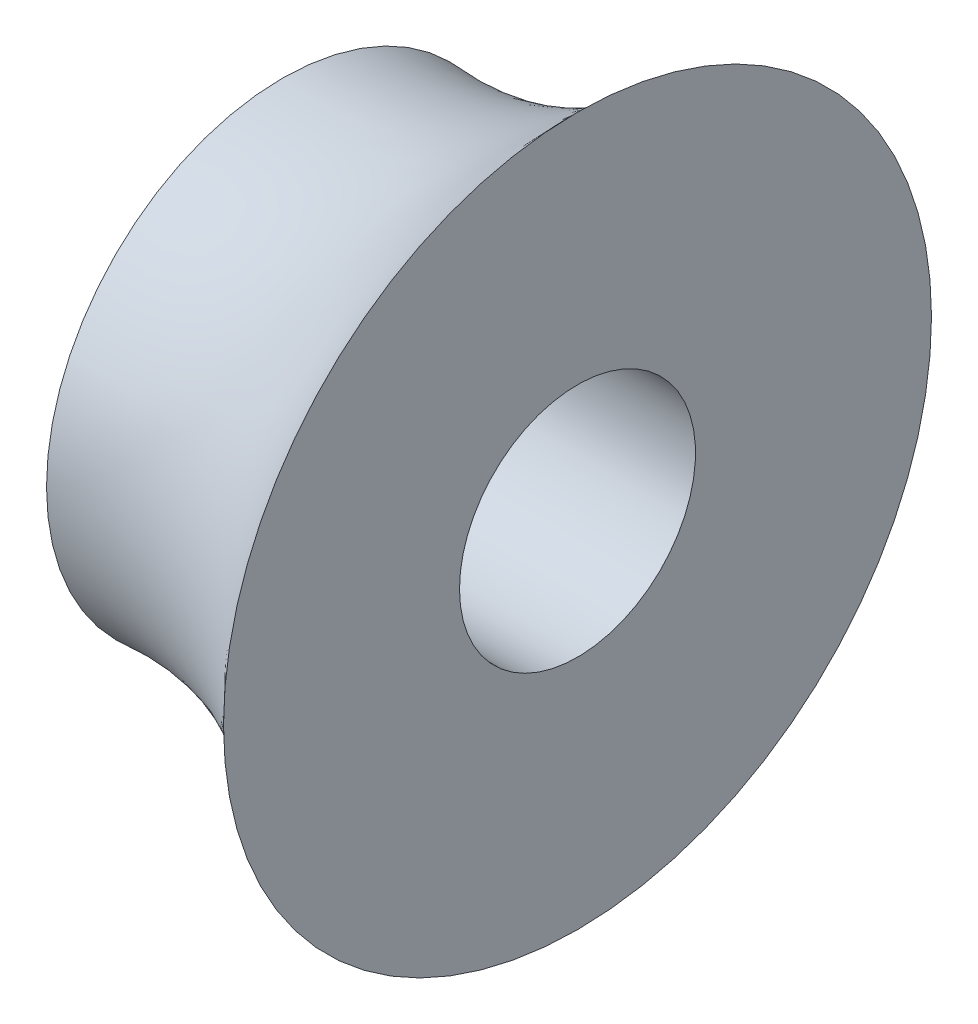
ISO-10303-21;
HEADER;
FILE_DESCRIPTION(('STEP AP214'),'2;1');
FILE_NAME('part.step','',(''),(''),'','','');
FILE_SCHEMA(('AUTOMOTIVE_DESIGN { 1 0 10303 214 1 1 1 1 }'));
ENDSEC;
DATA;
#1=APPLICATION_CONTEXT('core data for automotive mechanical design processes');
#2=APPLICATION_PROTOCOL_DEFINITION('international standard','automotive_design',2000,#1);
#3=PRODUCT_CONTEXT('',#1,'mechanical');
#4=PRODUCT('Part','Part','',(#3));
#5=PRODUCT_RELATED_PRODUCT_CATEGORY('part','',(#4));
#6=PRODUCT_DEFINITION_FORMATION('','',#4);
#7=PRODUCT_DEFINITION_CONTEXT('part definition',#1,'design');
#8=PRODUCT_DEFINITION('design','',#6,#7);
#9=PRODUCT_DEFINITION_SHAPE('','',#8);
#10=(LENGTH_UNIT() NAMED_UNIT(*) SI_UNIT(.MILLI.,.METRE.));
#11=(NAMED_UNIT(*) PLANE_ANGLE_UNIT() SI_UNIT($,.RADIAN.));
#12=(NAMED_UNIT(*) SI_UNIT($,.STERADIAN.) SOLID_ANGLE_UNIT());
#13=UNCERTAINTY_MEASURE_WITH_UNIT(LENGTH_MEASURE(1.E-05),#10,'distance_accuracy_value','');
#14=(GEOMETRIC_REPRESENTATION_CONTEXT(3) GLOBAL_UNCERTAINTY_ASSIGNED_CONTEXT((#13)) GLOBAL_UNIT_ASSIGNED_CONTEXT((#10,
#11,#12)) REPRESENTATION_CONTEXT('',''));
#15=CARTESIAN_POINT('',(0.,0.,0.));
#16=DIRECTION('',(0.,0.,1.));
#17=DIRECTION('',(1.,0.,0.));
#18=AXIS2_PLACEMENT_3D('',#15,#16,#17);
#19=CARTESIAN_POINT('',(-1.13694608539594,0.,0.));
#20=DIRECTION('',(-1.,0.,0.));
#21=DIRECTION('',(0.,0.,1.));
#22=AXIS2_PLACEMENT_3D('',#19,#20,#21);
#23=CYLINDRICAL_SURFACE('',#22,0.200000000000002);
#24=CARTESIAN_POINT('',(0.,0.,0.));
#25=DIRECTION('',(-1.,0.,0.));
#26=DIRECTION('',(0.,0.,1.));
#27=AXIS2_PLACEMENT_3D('',#24,#25,#26);
#28=CIRCLE('',#27,0.200000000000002);
#29=CARTESIAN_POINT('',(0.,0.,0.200000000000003));
#30=VERTEX_POINT('',#29);
#31=EDGE_CURVE('E10',#30,#30,#28,.T.);
#32=ORIENTED_EDGE('',*,*,#31,.F.);
#33=EDGE_LOOP('',(#32));
#34=FACE_BOUND('',#33,.T.);
#35=CARTESIAN_POINT('',(-0.5,0.,0.));
#36=DIRECTION('',(-1.,0.,0.));
#37=DIRECTION('',(0.,0.,1.));
#38=AXIS2_PLACEMENT_3D('',#35,#36,#37);
#39=CIRCLE('',#38,0.200000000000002);
#40=CARTESIAN_POINT('',(-0.5,0.,0.200000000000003));
#41=VERTEX_POINT('',#40);
#42=EDGE_CURVE('E36',#41,#41,#39,.T.);
#43=ORIENTED_EDGE('',*,*,#42,.T.);
#44=EDGE_LOOP('',(#43));
#45=FACE_BOUND('',#44,.T.);
#46=ADVANCED_FACE('F22',(#34,#45),#23,.F.);
#47=CARTESIAN_POINT('',(0.,0.,-0.2));
#48=DIRECTION('',(-1.,0.,0.));
#49=DIRECTION('',(0.,0.,1.));
#50=AXIS2_PLACEMENT_3D('',#47,#48,#49);
#51=PLANE('',#50);
#52=CARTESIAN_POINT('',(0.,0.,0.));
#53=DIRECTION('',(-1.,0.,0.));
#54=DIRECTION('',(0.,0.,1.));
#55=AXIS2_PLACEMENT_3D('',#52,#53,#54);
#56=CIRCLE('',#55,0.600000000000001);
#57=CARTESIAN_POINT('',(0.,0.,0.600000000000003));
#58=VERTEX_POINT('',#57);
#59=EDGE_CURVE('E28',#58,#58,#56,.T.);
#60=ORIENTED_EDGE('',*,*,#59,.F.);
#61=EDGE_LOOP('',(#60));
#62=FACE_BOUND('',#61,.T.);
#63=ORIENTED_EDGE('',*,*,#31,.T.);
#64=EDGE_LOOP('',(#63));
#65=FACE_BOUND('',#64,.T.);
#66=ADVANCED_FACE('F51',(#62,#65),#51,.F.);
#67=CARTESIAN_POINT('',(-0.449136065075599,0.,0.));
#68=DIRECTION('',(-1.,0.,0.));
#69=DIRECTION('',(0.,0.,1.));
#70=AXIS2_PLACEMENT_3D('',#67,#68,#69);
#71=TOROIDAL_SURFACE('',#70,0.997840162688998,0.6);
#72=CARTESIAN_POINT('',(-0.5,0.,0.));
#73=DIRECTION('',(-1.,0.,0.));
#74=DIRECTION('',(0.,0.,1.));
#75=AXIS2_PLACEMENT_3D('',#72,#73,#74);
#76=CIRCLE('',#75,0.400000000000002);
#77=CARTESIAN_POINT('',(-0.5,0.,0.400000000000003));
#78=VERTEX_POINT('',#77);
#79=EDGE_CURVE('E32',#78,#78,#76,.T.);
#80=ORIENTED_EDGE('',*,*,#79,.F.);
#81=EDGE_LOOP('',(#80));
#82=FACE_BOUND('',#81,.T.);
#83=ORIENTED_EDGE('',*,*,#59,.T.);
#84=EDGE_LOOP('',(#83));
#85=FACE_BOUND('',#84,.T.);
#86=ADVANCED_FACE('F46',(#82,#85),#71,.F.);
#87=CARTESIAN_POINT('',(-0.5,0.,-0.2));
#88=DIRECTION('',(1.,0.,0.));
#89=DIRECTION('',(0.,0.,-1.));
#90=AXIS2_PLACEMENT_3D('',#87,#88,#89);
#91=PLANE('',#90);
#92=ORIENTED_EDGE('',*,*,#42,.F.);
#93=EDGE_LOOP('',(#92));
#94=FACE_BOUND('',#93,.T.);
#95=ORIENTED_EDGE('',*,*,#79,.T.);
#96=EDGE_LOOP('',(#95));
#97=FACE_BOUND('',#96,.T.);
#98=ADVANCED_FACE('F43',(#94,#97),#91,.F.);
#99=CLOSED_SHELL('',(#46,#66,#86,#98));
#100=MANIFOLD_SOLID_BREP('B2',#99);
#101=ADVANCED_BREP_SHAPE_REPRESENTATION('',(#18,#100),#14);
#102=SHAPE_DEFINITION_REPRESENTATION(#9,#101);
ENDSEC;
END-ISO-10303-21;
